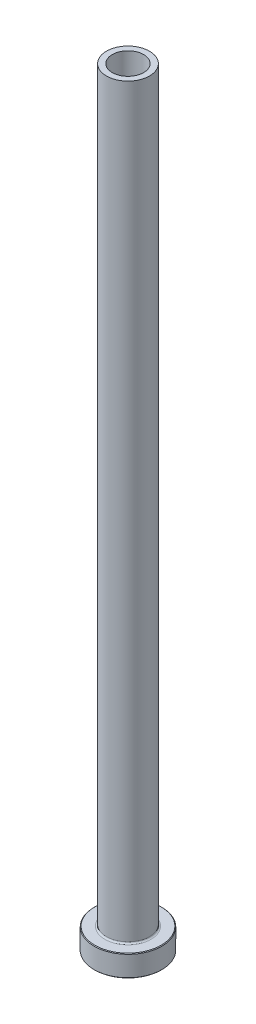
from build123d import *

# Parameters (mm, degrees)
FILLET1_R     = 0.5
CHAMFER1_SIZE = 0.2
CHAMFER3_SIZE = 0.5


with BuildPart() as part:
    # Sketch1 → Revolve1 (revolve)
    with BuildSketch(Plane.XY, mode=Mode.PRIVATE) as revolve1_sk:
        Polygon((-5.1, 250), (-7, 250), (-7, 7), (-11, 7), (-11, 0), (-5.35, 0), (-5.35, 183), (-5.1, 195), align=None)
    revolve(revolve1_sk.sketch.rotate(Axis((0, 92.187680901, 0), (0, -1, 0)), 270), axis=Axis((0, 92.187680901, 0), (0, -1, 0)))

    # Fillet1
    fillet1_edges = [part.edges().sort_by_distance(p)[0] for p in [
        (0, 7, -7),
    ]]
    fillet(fillet1_edges, radius=FILLET1_R)

    # Chamfer1
    chamfer1_edges = [part.edges().sort_by_distance(p)[0] for p in [
        (0, 0, -11),
        (0, 7, -11),
    ]]
    chamfer(chamfer1_edges, length=CHAMFER1_SIZE)

    # Chamfer3
    chamfer3_edges = [part.edges().sort_by_distance(p)[0] for p in [
        (0, 0, -5.35),
    ]]
    chamfer(chamfer3_edges, length=CHAMFER3_SIZE)


solid = part.part
